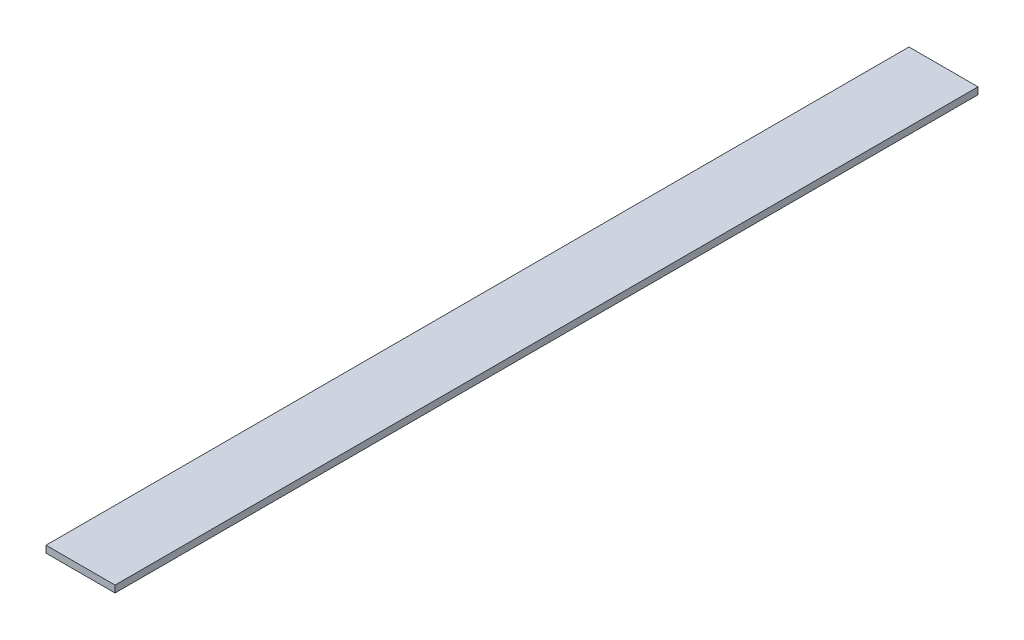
ISO-10303-21;
HEADER;
FILE_DESCRIPTION(('STEP AP214'),'2;1');
FILE_NAME('part.step','',(''),(''),'','','');
FILE_SCHEMA(('AUTOMOTIVE_DESIGN { 1 0 10303 214 1 1 1 1 }'));
ENDSEC;
DATA;
#1=APPLICATION_CONTEXT('core data for automotive mechanical design processes');
#2=APPLICATION_PROTOCOL_DEFINITION('international standard','automotive_design',2000,#1);
#3=PRODUCT_CONTEXT('',#1,'mechanical');
#4=PRODUCT('Part','Part','',(#3));
#5=PRODUCT_RELATED_PRODUCT_CATEGORY('part','',(#4));
#6=PRODUCT_DEFINITION_FORMATION('','',#4);
#7=PRODUCT_DEFINITION_CONTEXT('part definition',#1,'design');
#8=PRODUCT_DEFINITION('design','',#6,#7);
#9=PRODUCT_DEFINITION_SHAPE('','',#8);
#10=(LENGTH_UNIT() NAMED_UNIT(*) SI_UNIT(.MILLI.,.METRE.));
#11=(NAMED_UNIT(*) PLANE_ANGLE_UNIT() SI_UNIT($,.RADIAN.));
#12=(NAMED_UNIT(*) SI_UNIT($,.STERADIAN.) SOLID_ANGLE_UNIT());
#13=UNCERTAINTY_MEASURE_WITH_UNIT(LENGTH_MEASURE(1.E-05),#10,'distance_accuracy_value','');
#14=(GEOMETRIC_REPRESENTATION_CONTEXT(3) GLOBAL_UNCERTAINTY_ASSIGNED_CONTEXT((#13)) GLOBAL_UNIT_ASSIGNED_CONTEXT((#10,
#11,#12)) REPRESENTATION_CONTEXT('',''));
#15=CARTESIAN_POINT('',(0.,0.,0.));
#16=DIRECTION('',(0.,0.,1.));
#17=DIRECTION('',(1.,0.,0.));
#18=AXIS2_PLACEMENT_3D('',#15,#16,#17);
#19=CARTESIAN_POINT('',(20.,0.,0.));
#20=DIRECTION('',(-1.,0.,0.));
#21=DIRECTION('',(0.,0.,1.));
#22=AXIS2_PLACEMENT_3D('',#19,#20,#21);
#23=PLANE('',#22);
#24=DIRECTION('',(0.,-1.,0.));
#25=VECTOR('',#24,1.);
#26=CARTESIAN_POINT('',(20.,2.,0.));
#27=LINE('',#26,#25);
#28=CARTESIAN_POINT('',(20.,4.,0.));
#29=VERTEX_POINT('',#28);
#30=CARTESIAN_POINT('',(20.,0.,0.));
#31=VERTEX_POINT('',#30);
#32=EDGE_CURVE('E51',#29,#31,#27,.T.);
#33=ORIENTED_EDGE('',*,*,#32,.F.);
#34=DIRECTION('',(0.,0.,-1.));
#35=VECTOR('',#34,1.);
#36=CARTESIAN_POINT('',(20.,4.,250.));
#37=LINE('',#36,#35);
#38=CARTESIAN_POINT('',(20.,4.,500.));
#39=VERTEX_POINT('',#38);
#40=EDGE_CURVE('E66',#39,#29,#37,.T.);
#41=ORIENTED_EDGE('',*,*,#40,.F.);
#42=DIRECTION('',(0.,-1.,0.));
#43=VECTOR('',#42,1.);
#44=CARTESIAN_POINT('',(20.,2.,500.));
#45=LINE('',#44,#43);
#46=CARTESIAN_POINT('',(20.,0.,500.));
#47=VERTEX_POINT('',#46);
#48=EDGE_CURVE('E18',#39,#47,#45,.T.);
#49=ORIENTED_EDGE('',*,*,#48,.T.);
#50=DIRECTION('',(0.,0.,1.));
#51=VECTOR('',#50,1.);
#52=CARTESIAN_POINT('',(20.,0.,250.));
#53=LINE('',#52,#51);
#54=EDGE_CURVE('E56',#31,#47,#53,.T.);
#55=ORIENTED_EDGE('',*,*,#54,.F.);
#56=EDGE_LOOP('',(#33,#41,#49,#55));
#57=FACE_BOUND('',#56,.T.);
#58=ADVANCED_FACE('F14',(#57),#23,.F.);
#59=CARTESIAN_POINT('',(20.,0.,500.));
#60=DIRECTION('',(0.,0.,-1.));
#61=DIRECTION('',(-1.,0.,0.));
#62=AXIS2_PLACEMENT_3D('',#59,#60,#61);
#63=PLANE('',#62);
#64=DIRECTION('',(-1.,0.,0.));
#65=VECTOR('',#64,1.);
#66=CARTESIAN_POINT('',(0.,0.,500.));
#67=LINE('',#66,#65);
#68=CARTESIAN_POINT('',(-20.,0.,500.));
#69=VERTEX_POINT('',#68);
#70=EDGE_CURVE('E61',#47,#69,#67,.T.);
#71=ORIENTED_EDGE('',*,*,#70,.F.);
#72=ORIENTED_EDGE('',*,*,#48,.F.);
#73=DIRECTION('',(1.,0.,0.));
#74=VECTOR('',#73,1.);
#75=CARTESIAN_POINT('',(0.,4.,500.));
#76=LINE('',#75,#74);
#77=CARTESIAN_POINT('',(-20.,4.,500.));
#78=VERTEX_POINT('',#77);
#79=EDGE_CURVE('E79',#78,#39,#76,.T.);
#80=ORIENTED_EDGE('',*,*,#79,.F.);
#81=DIRECTION('',(0.,-1.,0.));
#82=VECTOR('',#81,1.);
#83=CARTESIAN_POINT('',(-20.,2.,500.));
#84=LINE('',#83,#82);
#85=EDGE_CURVE('E72',#78,#69,#84,.T.);
#86=ORIENTED_EDGE('',*,*,#85,.T.);
#87=EDGE_LOOP('',(#71,#72,#80,#86));
#88=FACE_BOUND('',#87,.T.);
#89=ADVANCED_FACE('F71',(#88),#63,.F.);
#90=CARTESIAN_POINT('',(-20.,0.,500.));
#91=DIRECTION('',(0.,-1.,0.));
#92=DIRECTION('',(0.,0.,-1.));
#93=AXIS2_PLACEMENT_3D('',#90,#91,#92);
#94=PLANE('',#93);
#95=ORIENTED_EDGE('',*,*,#70,.T.);
#96=DIRECTION('',(0.,0.,-1.));
#97=VECTOR('',#96,1.);
#98=CARTESIAN_POINT('',(-20.,0.,250.));
#99=LINE('',#98,#97);
#100=CARTESIAN_POINT('',(-20.,0.,0.));
#101=VERTEX_POINT('',#100);
#102=EDGE_CURVE('E82',#69,#101,#99,.T.);
#103=ORIENTED_EDGE('',*,*,#102,.T.);
#104=DIRECTION('',(-1.,0.,0.));
#105=VECTOR('',#104,1.);
#106=CARTESIAN_POINT('',(0.,0.,0.));
#107=LINE('',#106,#105);
#108=EDGE_CURVE('E63',#31,#101,#107,.T.);
#109=ORIENTED_EDGE('',*,*,#108,.F.);
#110=ORIENTED_EDGE('',*,*,#54,.T.);
#111=EDGE_LOOP('',(#95,#103,#109,#110));
#112=FACE_BOUND('',#111,.T.);
#113=ADVANCED_FACE('F58',(#112),#94,.T.);
#114=CARTESIAN_POINT('',(20.,0.,0.));
#115=DIRECTION('',(0.,0.,-1.));
#116=DIRECTION('',(-1.,0.,0.));
#117=AXIS2_PLACEMENT_3D('',#114,#115,#116);
#118=PLANE('',#117);
#119=ORIENTED_EDGE('',*,*,#32,.T.);
#120=ORIENTED_EDGE('',*,*,#108,.T.);
#121=DIRECTION('',(0.,1.,0.));
#122=VECTOR('',#121,1.);
#123=CARTESIAN_POINT('',(-20.,2.,0.));
#124=LINE('',#123,#122);
#125=CARTESIAN_POINT('',(-20.,4.,0.));
#126=VERTEX_POINT('',#125);
#127=EDGE_CURVE('E24',#101,#126,#124,.T.);
#128=ORIENTED_EDGE('',*,*,#127,.T.);
#129=DIRECTION('',(-1.,0.,0.));
#130=VECTOR('',#129,1.);
#131=CARTESIAN_POINT('',(0.,4.,0.));
#132=LINE('',#131,#130);
#133=EDGE_CURVE('E32',#29,#126,#132,.T.);
#134=ORIENTED_EDGE('',*,*,#133,.F.);
#135=EDGE_LOOP('',(#119,#120,#128,#134));
#136=FACE_BOUND('',#135,.T.);
#137=ADVANCED_FACE('F86',(#136),#118,.T.);
#138=CARTESIAN_POINT('',(20.,4.,0.));
#139=DIRECTION('',(0.,1.,0.));
#140=DIRECTION('',(-1.,0.,0.));
#141=AXIS2_PLACEMENT_3D('',#138,#139,#140);
#142=PLANE('',#141);
#143=DIRECTION('',(0.,0.,1.));
#144=VECTOR('',#143,1.);
#145=CARTESIAN_POINT('',(-20.,4.,250.));
#146=LINE('',#145,#144);
#147=EDGE_CURVE('E9',#126,#78,#146,.T.);
#148=ORIENTED_EDGE('',*,*,#147,.T.);
#149=ORIENTED_EDGE('',*,*,#79,.T.);
#150=ORIENTED_EDGE('',*,*,#40,.T.);
#151=ORIENTED_EDGE('',*,*,#133,.T.);
#152=EDGE_LOOP('',(#148,#149,#150,#151));
#153=FACE_BOUND('',#152,.T.);
#154=ADVANCED_FACE('F88',(#153),#142,.T.);
#155=CARTESIAN_POINT('',(-20.,0.,500.));
#156=DIRECTION('',(1.,0.,0.));
#157=DIRECTION('',(0.,0.,-1.));
#158=AXIS2_PLACEMENT_3D('',#155,#156,#157);
#159=PLANE('',#158);
#160=ORIENTED_EDGE('',*,*,#127,.F.);
#161=ORIENTED_EDGE('',*,*,#102,.F.);
#162=ORIENTED_EDGE('',*,*,#85,.F.);
#163=ORIENTED_EDGE('',*,*,#147,.F.);
#164=EDGE_LOOP('',(#160,#161,#162,#163));
#165=FACE_BOUND('',#164,.T.);
#166=ADVANCED_FACE('F16',(#165),#159,.F.);
#167=CLOSED_SHELL('',(#58,#89,#113,#137,#154,#166));
#168=MANIFOLD_SOLID_BREP('B1',#167);
#169=ADVANCED_BREP_SHAPE_REPRESENTATION('',(#18,#168),#14);
#170=SHAPE_DEFINITION_REPRESENTATION(#9,#169);
ENDSEC;
END-ISO-10303-21;
